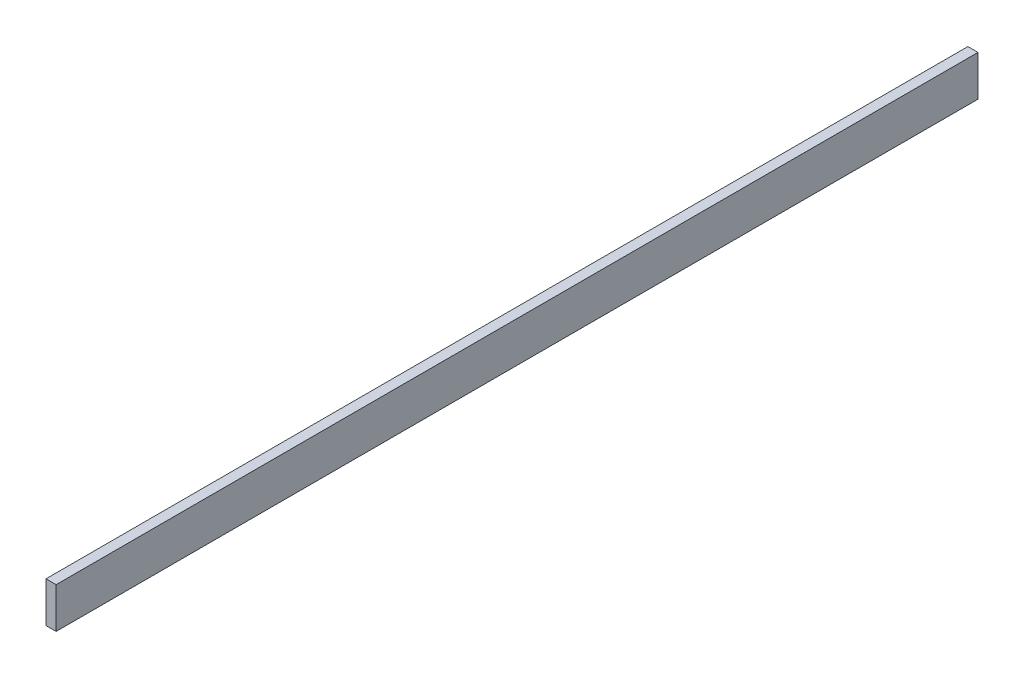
ISO-10303-21;
HEADER;
FILE_DESCRIPTION(('STEP AP214'),'2;1');
FILE_NAME('part.step','',(''),(''),'','','');
FILE_SCHEMA(('AUTOMOTIVE_DESIGN { 1 0 10303 214 1 1 1 1 }'));
ENDSEC;
DATA;
#1=APPLICATION_CONTEXT('core data for automotive mechanical design processes');
#2=APPLICATION_PROTOCOL_DEFINITION('international standard','automotive_design',2000,#1);
#3=PRODUCT_CONTEXT('',#1,'mechanical');
#4=PRODUCT('Part','Part','',(#3));
#5=PRODUCT_RELATED_PRODUCT_CATEGORY('part','',(#4));
#6=PRODUCT_DEFINITION_FORMATION('','',#4);
#7=PRODUCT_DEFINITION_CONTEXT('part definition',#1,'design');
#8=PRODUCT_DEFINITION('design','',#6,#7);
#9=PRODUCT_DEFINITION_SHAPE('','',#8);
#10=(LENGTH_UNIT() NAMED_UNIT(*) SI_UNIT(.MILLI.,.METRE.));
#11=(NAMED_UNIT(*) PLANE_ANGLE_UNIT() SI_UNIT($,.RADIAN.));
#12=(NAMED_UNIT(*) SI_UNIT($,.STERADIAN.) SOLID_ANGLE_UNIT());
#13=UNCERTAINTY_MEASURE_WITH_UNIT(LENGTH_MEASURE(1.E-05),#10,'distance_accuracy_value','');
#14=(GEOMETRIC_REPRESENTATION_CONTEXT(3) GLOBAL_UNCERTAINTY_ASSIGNED_CONTEXT((#13)) GLOBAL_UNIT_ASSIGNED_CONTEXT((#10,
#11,#12)) REPRESENTATION_CONTEXT('',''));
#15=CARTESIAN_POINT('',(0.,0.,0.));
#16=DIRECTION('',(0.,0.,1.));
#17=DIRECTION('',(1.,0.,0.));
#18=AXIS2_PLACEMENT_3D('',#15,#16,#17);
#19=CARTESIAN_POINT('',(12.7,-50.8,2311.4));
#20=DIRECTION('',(-1.,0.,0.));
#21=DIRECTION('',(0.,0.,1.));
#22=AXIS2_PLACEMENT_3D('',#19,#20,#21);
#23=PLANE('',#22);
#24=DIRECTION('',(0.,1.,0.));
#25=VECTOR('',#24,1.);
#26=CARTESIAN_POINT('',(12.7,-50.8,0.));
#27=LINE('',#26,#25);
#28=CARTESIAN_POINT('',(12.7,-50.8,0.));
#29=VERTEX_POINT('',#28);
#30=CARTESIAN_POINT('',(12.7,50.8,0.));
#31=VERTEX_POINT('',#30);
#32=EDGE_CURVE('E96',#29,#31,#27,.T.);
#33=ORIENTED_EDGE('',*,*,#32,.T.);
#34=DIRECTION('',(0.,0.,-1.));
#35=VECTOR('',#34,1.);
#36=CARTESIAN_POINT('',(12.7,50.8,2311.4));
#37=LINE('',#36,#35);
#38=CARTESIAN_POINT('',(12.7,50.8,2311.4));
#39=VERTEX_POINT('',#38);
#40=EDGE_CURVE('E11',#39,#31,#37,.T.);
#41=ORIENTED_EDGE('',*,*,#40,.F.);
#42=DIRECTION('',(0.,1.,0.));
#43=VECTOR('',#42,1.);
#44=CARTESIAN_POINT('',(12.7,-50.8,2311.4));
#45=LINE('',#44,#43);
#46=CARTESIAN_POINT('',(12.7,-50.8,2311.4));
#47=VERTEX_POINT('',#46);
#48=EDGE_CURVE('E84',#47,#39,#45,.T.);
#49=ORIENTED_EDGE('',*,*,#48,.F.);
#50=DIRECTION('',(0.,0.,-1.));
#51=VECTOR('',#50,1.);
#52=CARTESIAN_POINT('',(12.7,-50.8,2311.4));
#53=LINE('',#52,#51);
#54=EDGE_CURVE('E92',#47,#29,#53,.T.);
#55=ORIENTED_EDGE('',*,*,#54,.T.);
#56=EDGE_LOOP('',(#33,#41,#49,#55));
#57=FACE_BOUND('',#56,.T.);
#58=ADVANCED_FACE('F33',(#57),#23,.F.);
#59=CARTESIAN_POINT('',(-12.7,50.8,2311.4));
#60=DIRECTION('',(0.,-1.,0.));
#61=DIRECTION('',(0.,0.,-1.));
#62=AXIS2_PLACEMENT_3D('',#59,#60,#61);
#63=PLANE('',#62);
#64=DIRECTION('',(-1.,0.,0.));
#65=VECTOR('',#64,1.);
#66=CARTESIAN_POINT('',(-12.7,50.8,0.));
#67=LINE('',#66,#65);
#68=CARTESIAN_POINT('',(-12.7,50.8,0.));
#69=VERTEX_POINT('',#68);
#70=EDGE_CURVE('E88',#31,#69,#67,.T.);
#71=ORIENTED_EDGE('',*,*,#70,.T.);
#72=DIRECTION('',(0.,0.,-1.));
#73=VECTOR('',#72,1.);
#74=CARTESIAN_POINT('',(-12.7,50.8,2311.4));
#75=LINE('',#74,#73);
#76=CARTESIAN_POINT('',(-12.7,50.8,2311.4));
#77=VERTEX_POINT('',#76);
#78=EDGE_CURVE('E41',#77,#69,#75,.T.);
#79=ORIENTED_EDGE('',*,*,#78,.F.);
#80=DIRECTION('',(-1.,0.,0.));
#81=VECTOR('',#80,1.);
#82=CARTESIAN_POINT('',(-12.7,50.8,2311.4));
#83=LINE('',#82,#81);
#84=EDGE_CURVE('E79',#39,#77,#83,.T.);
#85=ORIENTED_EDGE('',*,*,#84,.F.);
#86=ORIENTED_EDGE('',*,*,#40,.T.);
#87=EDGE_LOOP('',(#71,#79,#85,#86));
#88=FACE_BOUND('',#87,.T.);
#89=ADVANCED_FACE('F87',(#88),#63,.F.);
#90=CARTESIAN_POINT('',(-12.7,-50.8,2311.4));
#91=DIRECTION('',(1.,0.,0.));
#92=DIRECTION('',(0.,0.,-1.));
#93=AXIS2_PLACEMENT_3D('',#90,#91,#92);
#94=PLANE('',#93);
#95=DIRECTION('',(0.,-1.,0.));
#96=VECTOR('',#95,1.);
#97=CARTESIAN_POINT('',(-12.7,-50.8,0.));
#98=LINE('',#97,#96);
#99=CARTESIAN_POINT('',(-12.7,-50.8,0.));
#100=VERTEX_POINT('',#99);
#101=EDGE_CURVE('E66',#69,#100,#98,.T.);
#102=ORIENTED_EDGE('',*,*,#101,.T.);
#103=DIRECTION('',(0.,0.,-1.));
#104=VECTOR('',#103,1.);
#105=CARTESIAN_POINT('',(-12.7,-50.8,2311.4));
#106=LINE('',#105,#104);
#107=CARTESIAN_POINT('',(-12.7,-50.8,2311.4));
#108=VERTEX_POINT('',#107);
#109=EDGE_CURVE('E89',#108,#100,#106,.T.);
#110=ORIENTED_EDGE('',*,*,#109,.F.);
#111=DIRECTION('',(0.,-1.,0.));
#112=VECTOR('',#111,1.);
#113=CARTESIAN_POINT('',(-12.7,-50.8,2311.4));
#114=LINE('',#113,#112);
#115=EDGE_CURVE('E82',#77,#108,#114,.T.);
#116=ORIENTED_EDGE('',*,*,#115,.F.);
#117=ORIENTED_EDGE('',*,*,#78,.T.);
#118=EDGE_LOOP('',(#102,#110,#116,#117));
#119=FACE_BOUND('',#118,.T.);
#120=ADVANCED_FACE('F90',(#119),#94,.F.);
#121=CARTESIAN_POINT('',(-12.7,-50.8,2311.4));
#122=DIRECTION('',(0.,1.,0.));
#123=DIRECTION('',(0.,0.,1.));
#124=AXIS2_PLACEMENT_3D('',#121,#122,#123);
#125=PLANE('',#124);
#126=DIRECTION('',(1.,0.,0.));
#127=VECTOR('',#126,1.);
#128=CARTESIAN_POINT('',(-12.7,-50.8,0.));
#129=LINE('',#128,#127);
#130=EDGE_CURVE('E72',#100,#29,#129,.T.);
#131=ORIENTED_EDGE('',*,*,#130,.T.);
#132=ORIENTED_EDGE('',*,*,#54,.F.);
#133=DIRECTION('',(1.,0.,0.));
#134=VECTOR('',#133,1.);
#135=CARTESIAN_POINT('',(-12.7,-50.8,2311.4));
#136=LINE('',#135,#134);
#137=EDGE_CURVE('E49',#108,#47,#136,.T.);
#138=ORIENTED_EDGE('',*,*,#137,.F.);
#139=ORIENTED_EDGE('',*,*,#109,.T.);
#140=EDGE_LOOP('',(#131,#132,#138,#139));
#141=FACE_BOUND('',#140,.T.);
#142=ADVANCED_FACE('F103',(#141),#125,.F.);
#143=CARTESIAN_POINT('',(0.,0.,2311.4));
#144=DIRECTION('',(0.,0.,-1.));
#145=DIRECTION('',(-1.,0.,0.));
#146=AXIS2_PLACEMENT_3D('',#143,#144,#145);
#147=PLANE('',#146);
#148=ORIENTED_EDGE('',*,*,#48,.T.);
#149=ORIENTED_EDGE('',*,*,#84,.T.);
#150=ORIENTED_EDGE('',*,*,#115,.T.);
#151=ORIENTED_EDGE('',*,*,#137,.T.);
#152=EDGE_LOOP('',(#148,#149,#150,#151));
#153=FACE_BOUND('',#152,.T.);
#154=ADVANCED_FACE('F80',(#153),#147,.F.);
#155=CARTESIAN_POINT('',(0.,0.,0.));
#156=DIRECTION('',(0.,0.,-1.));
#157=DIRECTION('',(-1.,0.,0.));
#158=AXIS2_PLACEMENT_3D('',#155,#156,#157);
#159=PLANE('',#158);
#160=ORIENTED_EDGE('',*,*,#32,.F.);
#161=ORIENTED_EDGE('',*,*,#130,.F.);
#162=ORIENTED_EDGE('',*,*,#101,.F.);
#163=ORIENTED_EDGE('',*,*,#70,.F.);
#164=EDGE_LOOP('',(#160,#161,#162,#163));
#165=FACE_BOUND('',#164,.T.);
#166=ADVANCED_FACE('F106',(#165),#159,.T.);
#167=CLOSED_SHELL('',(#58,#89,#120,#142,#154,#166));
#168=MANIFOLD_SOLID_BREP('B2',#167);
#169=ADVANCED_BREP_SHAPE_REPRESENTATION('',(#18,#168),#14);
#170=SHAPE_DEFINITION_REPRESENTATION(#9,#169);
ENDSEC;
END-ISO-10303-21;
